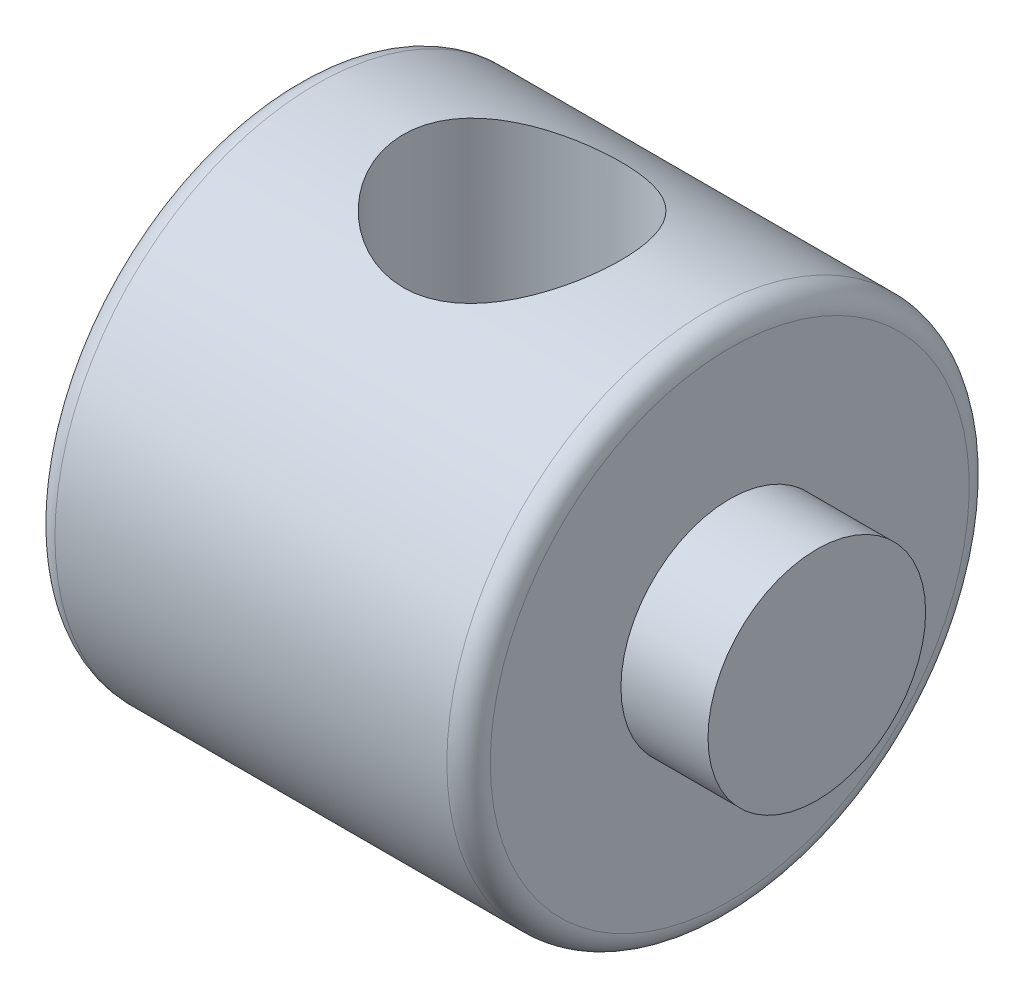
from build123d import *

# Parameters (mm, degrees)
FILLET1_R               = 0.79248
F_3_8_16_TAPPED_HOLE1_D = 7.9375


with BuildPart() as part:
    # Sketch1 → Revolve1 (revolve)
    with BuildSketch(Plane.XY, mode=Mode.PRIVATE) as revolve1_sk:
        Polygon((-11.1125, 0), (-11.1125, 3.96875), (-7.9375, 3.96875), (-7.9375, 9.525), (7.9375, 9.525), (7.9375, 3.96875), (11.1125, 3.96875), (11.1125, 0), align=None)
    revolve(revolve1_sk.sketch.rotate(Axis((-58.389715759, 0, 0), (1, 0, 0)), 90), axis=Axis((-58.389715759, 0, 0), (1, 0, 0)))

    # Fillet1
    fillet1_edges = [part.edges().sort_by_distance(p)[0] for p in [
        (7.9375, 0, -9.525),
        (-7.9375, 0, -9.525),
    ]]
    fillet(fillet1_edges, radius=FILLET1_R)

    # 3_8-16 Tapped Hole1 (through all)
    with Locations(Plane.ZX.offset(9.525)):
        with Locations((0, 0)):
            Hole(F_3_8_16_TAPPED_HOLE1_D / 2)


solid = part.part
